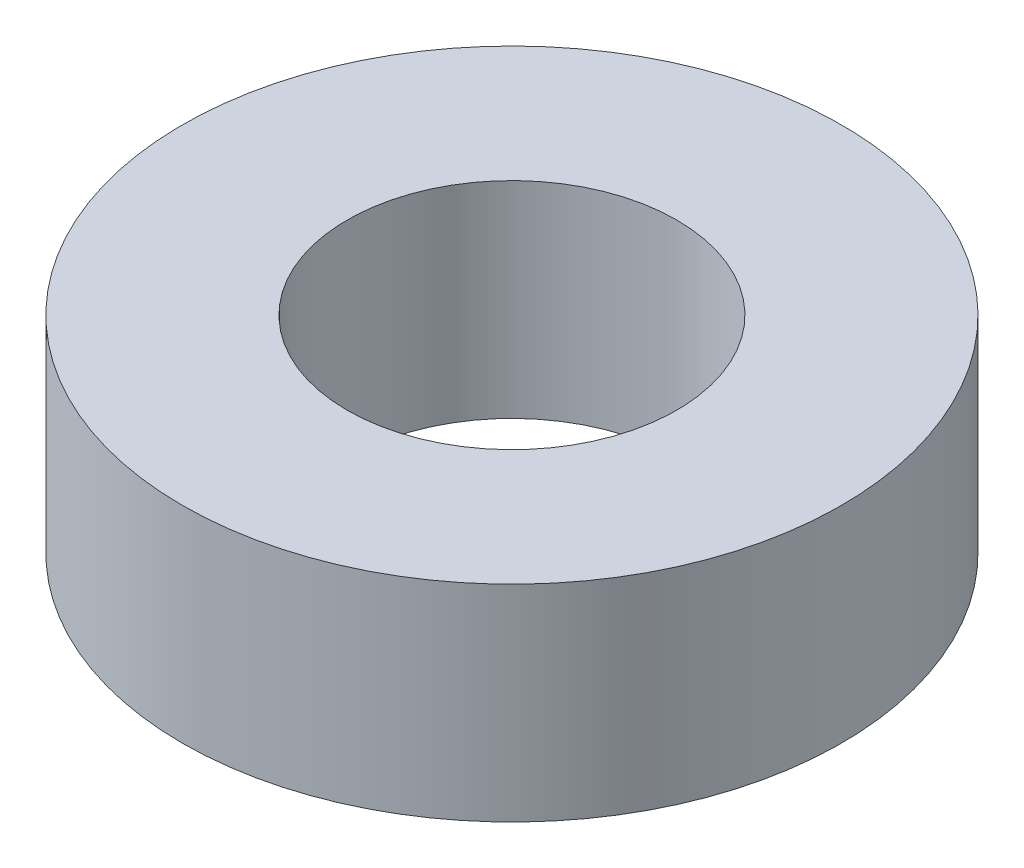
ISO-10303-21;
HEADER;
FILE_DESCRIPTION(('STEP AP214'),'2;1');
FILE_NAME('part.step','',(''),(''),'','','');
FILE_SCHEMA(('AUTOMOTIVE_DESIGN { 1 0 10303 214 1 1 1 1 }'));
ENDSEC;
DATA;
#1=APPLICATION_CONTEXT('core data for automotive mechanical design processes');
#2=APPLICATION_PROTOCOL_DEFINITION('international standard','automotive_design',2000,#1);
#3=PRODUCT_CONTEXT('',#1,'mechanical');
#4=PRODUCT('Part','Part','',(#3));
#5=PRODUCT_RELATED_PRODUCT_CATEGORY('part','',(#4));
#6=PRODUCT_DEFINITION_FORMATION('','',#4);
#7=PRODUCT_DEFINITION_CONTEXT('part definition',#1,'design');
#8=PRODUCT_DEFINITION('design','',#6,#7);
#9=PRODUCT_DEFINITION_SHAPE('','',#8);
#10=(LENGTH_UNIT() NAMED_UNIT(*) SI_UNIT(.MILLI.,.METRE.));
#11=(NAMED_UNIT(*) PLANE_ANGLE_UNIT() SI_UNIT($,.RADIAN.));
#12=(NAMED_UNIT(*) SI_UNIT($,.STERADIAN.) SOLID_ANGLE_UNIT());
#13=UNCERTAINTY_MEASURE_WITH_UNIT(LENGTH_MEASURE(1.E-05),#10,'distance_accuracy_value','');
#14=(GEOMETRIC_REPRESENTATION_CONTEXT(3) GLOBAL_UNCERTAINTY_ASSIGNED_CONTEXT((#13)) GLOBAL_UNIT_ASSIGNED_CONTEXT((#10,
#11,#12)) REPRESENTATION_CONTEXT('',''));
#15=CARTESIAN_POINT('',(0.,0.,0.));
#16=DIRECTION('',(0.,0.,1.));
#17=DIRECTION('',(1.,0.,0.));
#18=AXIS2_PLACEMENT_3D('',#15,#16,#17);
#19=CARTESIAN_POINT('',(0.,2.5,0.));
#20=DIRECTION('',(0.,1.,0.));
#21=DIRECTION('',(0.,0.,1.));
#22=AXIS2_PLACEMENT_3D('',#19,#20,#21);
#23=PLANE('',#22);
#24=CARTESIAN_POINT('',(0.,2.5,0.));
#25=DIRECTION('',(0.,1.,0.));
#26=DIRECTION('',(0.,0.,1.));
#27=AXIS2_PLACEMENT_3D('',#24,#25,#26);
#28=CIRCLE('',#27,4.);
#29=CARTESIAN_POINT('',(0.,2.5,4.));
#30=VERTEX_POINT('',#29);
#31=EDGE_CURVE('E10',#30,#30,#28,.T.);
#32=ORIENTED_EDGE('',*,*,#31,.T.);
#33=EDGE_LOOP('',(#32));
#34=FACE_BOUND('',#33,.T.);
#35=CARTESIAN_POINT('',(0.,2.5,0.));
#36=DIRECTION('',(0.,1.,0.));
#37=DIRECTION('',(0.,0.,1.));
#38=AXIS2_PLACEMENT_3D('',#35,#36,#37);
#39=CIRCLE('',#38,2.);
#40=CARTESIAN_POINT('',(0.,2.5,2.));
#41=VERTEX_POINT('',#40);
#42=EDGE_CURVE('E43',#41,#41,#39,.T.);
#43=ORIENTED_EDGE('',*,*,#42,.F.);
#44=EDGE_LOOP('',(#43));
#45=FACE_BOUND('',#44,.T.);
#46=ADVANCED_FACE('F32',(#34,#45),#23,.T.);
#47=CARTESIAN_POINT('',(0.,0.,0.));
#48=DIRECTION('',(0.,1.,0.));
#49=DIRECTION('',(0.,0.,1.));
#50=AXIS2_PLACEMENT_3D('',#47,#48,#49);
#51=PLANE('',#50);
#52=CARTESIAN_POINT('',(0.,0.,0.));
#53=DIRECTION('',(0.,1.,0.));
#54=DIRECTION('',(0.,0.,1.));
#55=AXIS2_PLACEMENT_3D('',#52,#53,#54);
#56=CIRCLE('',#55,4.);
#57=CARTESIAN_POINT('',(0.,0.,4.));
#58=VERTEX_POINT('',#57);
#59=EDGE_CURVE('E36',#58,#58,#56,.T.);
#60=ORIENTED_EDGE('',*,*,#59,.F.);
#61=EDGE_LOOP('',(#60));
#62=FACE_BOUND('',#61,.T.);
#63=CARTESIAN_POINT('',(0.,0.,0.));
#64=DIRECTION('',(0.,1.,0.));
#65=DIRECTION('',(0.,0.,1.));
#66=AXIS2_PLACEMENT_3D('',#63,#64,#65);
#67=CIRCLE('',#66,2.);
#68=CARTESIAN_POINT('',(0.,0.,2.));
#69=VERTEX_POINT('',#68);
#70=EDGE_CURVE('E45',#69,#69,#67,.T.);
#71=ORIENTED_EDGE('',*,*,#70,.T.);
#72=EDGE_LOOP('',(#71));
#73=FACE_BOUND('',#72,.T.);
#74=ADVANCED_FACE('F55',(#62,#73),#51,.F.);
#75=CARTESIAN_POINT('',(0.,2.5,0.));
#76=DIRECTION('',(0.,-1.,0.));
#77=DIRECTION('',(0.,0.,-1.));
#78=AXIS2_PLACEMENT_3D('',#75,#76,#77);
#79=CYLINDRICAL_SURFACE('',#78,4.);
#80=ORIENTED_EDGE('',*,*,#31,.F.);
#81=EDGE_LOOP('',(#80));
#82=FACE_BOUND('',#81,.T.);
#83=ORIENTED_EDGE('',*,*,#59,.T.);
#84=EDGE_LOOP('',(#83));
#85=FACE_BOUND('',#84,.T.);
#86=ADVANCED_FACE('F34',(#82,#85),#79,.T.);
#87=CARTESIAN_POINT('',(0.,2.5,0.));
#88=DIRECTION('',(0.,-1.,0.));
#89=DIRECTION('',(0.,0.,-1.));
#90=AXIS2_PLACEMENT_3D('',#87,#88,#89);
#91=CYLINDRICAL_SURFACE('',#90,2.);
#92=ORIENTED_EDGE('',*,*,#42,.T.);
#93=EDGE_LOOP('',(#92));
#94=FACE_BOUND('',#93,.T.);
#95=ORIENTED_EDGE('',*,*,#70,.F.);
#96=EDGE_LOOP('',(#95));
#97=FACE_BOUND('',#96,.T.);
#98=ADVANCED_FACE('F51',(#94,#97),#91,.F.);
#99=CLOSED_SHELL('',(#46,#74,#86,#98));
#100=MANIFOLD_SOLID_BREP('B2',#99);
#101=ADVANCED_BREP_SHAPE_REPRESENTATION('',(#18,#100),#14);
#102=SHAPE_DEFINITION_REPRESENTATION(#9,#101);
ENDSEC;
END-ISO-10303-21;
